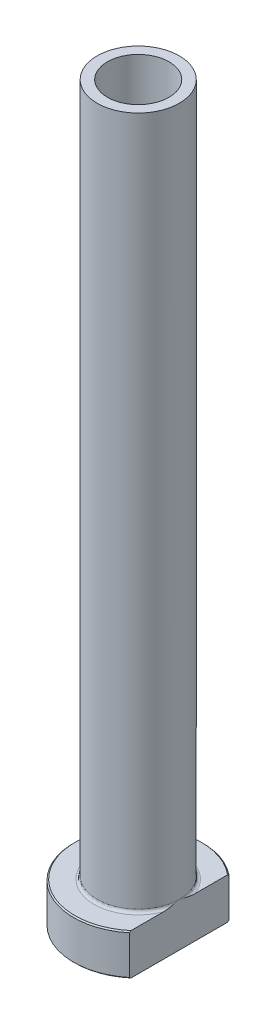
from build123d import *

# Parameters (mm, degrees)
FILLET1_R          = 0.5
CHAMFER1_SIZE      = 0.2
CUT_EXTRUDE1_DEPTH = 126.964280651
CHAMFER2_SIZE      = 0.5


with BuildPart() as part:
    # Sketch1 → Revolve1 (revolve)
    with BuildSketch(Plane.XY, mode=Mode.PRIVATE) as revolve1_sk:
        Polygon((-5.25, 125), (-7, 125), (-7, 7), (-11, 7), (-11, 0), (-5.5, 0), (-5.5, 58), (-5.25, 70), align=None)
    revolve(revolve1_sk.sketch.rotate(Axis((0, 92.187680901, 0), (0, -1, 0)), 270), axis=Axis((0, 92.187680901, 0), (0, -1, 0)))

    # Fillet1
    fillet1_edges = [part.edges().sort_by_distance(p)[0] for p in [
        (0, 7, -7),
    ]]
    fillet(fillet1_edges, radius=FILLET1_R)

    # Chamfer1
    chamfer1_edges = [part.edges().sort_by_distance(p)[0] for p in [
        (0, 0, -11),
        (0, 7, -11),
    ]]
    chamfer(chamfer1_edges, length=CHAMFER1_SIZE)

    # Sketch2 → Cut-Extrude1 (cut, through all)
    with BuildSketch(Plane.XZ):
        with BuildLine():
            Line((7, 8.485281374), (7, -8.485281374))
            ThreePointArc((7, -8.485281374), (11, 0), (7, 8.485281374))
        make_face()
    extrude(amount=-CUT_EXTRUDE1_DEPTH, mode=Mode.SUBTRACT)

    # Chamfer2
    chamfer2_edges = [part.edges().sort_by_distance(p)[0] for p in [
        (0, 0, -5.5),
    ]]
    chamfer(chamfer2_edges, length=CHAMFER2_SIZE)


solid = part.part
